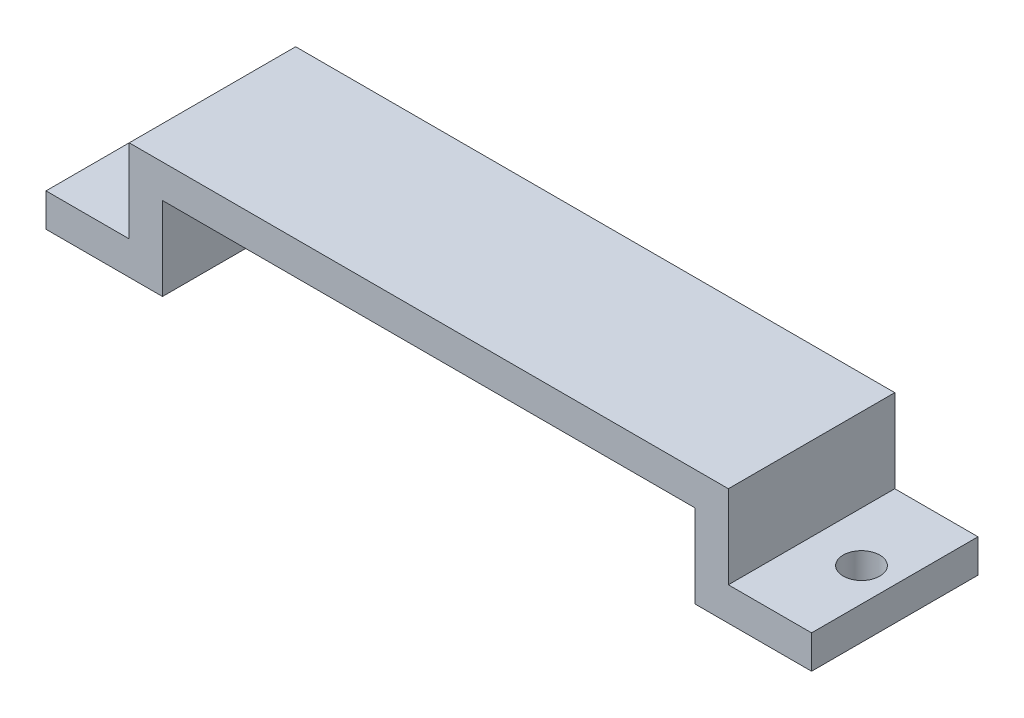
ISO-10303-21;
HEADER;
FILE_DESCRIPTION(('STEP AP214'),'2;1');
FILE_NAME('part.step','',(''),(''),'','','');
FILE_SCHEMA(('AUTOMOTIVE_DESIGN { 1 0 10303 214 1 1 1 1 }'));
ENDSEC;
DATA;
#1=APPLICATION_CONTEXT('core data for automotive mechanical design processes');
#2=APPLICATION_PROTOCOL_DEFINITION('international standard','automotive_design',2000,#1);
#3=PRODUCT_CONTEXT('',#1,'mechanical');
#4=PRODUCT('Part','Part','',(#3));
#5=PRODUCT_RELATED_PRODUCT_CATEGORY('part','',(#4));
#6=PRODUCT_DEFINITION_FORMATION('','',#4);
#7=PRODUCT_DEFINITION_CONTEXT('part definition',#1,'design');
#8=PRODUCT_DEFINITION('design','',#6,#7);
#9=PRODUCT_DEFINITION_SHAPE('','',#8);
#10=(LENGTH_UNIT() NAMED_UNIT(*) SI_UNIT(.MILLI.,.METRE.));
#11=(NAMED_UNIT(*) PLANE_ANGLE_UNIT() SI_UNIT($,.RADIAN.));
#12=(NAMED_UNIT(*) SI_UNIT($,.STERADIAN.) SOLID_ANGLE_UNIT());
#13=UNCERTAINTY_MEASURE_WITH_UNIT(LENGTH_MEASURE(1.E-05),#10,'distance_accuracy_value','');
#14=(GEOMETRIC_REPRESENTATION_CONTEXT(3) GLOBAL_UNCERTAINTY_ASSIGNED_CONTEXT((#13)) GLOBAL_UNIT_ASSIGNED_CONTEXT((#10,
#11,#12)) REPRESENTATION_CONTEXT('',''));
#15=CARTESIAN_POINT('',(0.,0.,0.));
#16=DIRECTION('',(0.,0.,1.));
#17=DIRECTION('',(1.,0.,0.));
#18=AXIS2_PLACEMENT_3D('',#15,#16,#17);
#19=CARTESIAN_POINT('',(-16.,0.,5.));
#20=DIRECTION('',(-1.,0.,0.));
#21=DIRECTION('',(0.,0.,1.));
#22=AXIS2_PLACEMENT_3D('',#19,#20,#21);
#23=PLANE('',#22);
#24=DIRECTION('',(0.,1.,0.));
#25=VECTOR('',#24,1.);
#26=CARTESIAN_POINT('',(-16.,0.,-5.));
#27=LINE('',#26,#25);
#28=CARTESIAN_POINT('',(-16.,-5.,-5.));
#29=VERTEX_POINT('',#28);
#30=CARTESIAN_POINT('',(-16.,0.,-5.));
#31=VERTEX_POINT('',#30);
#32=EDGE_CURVE('E170',#29,#31,#27,.T.);
#33=ORIENTED_EDGE('',*,*,#32,.T.);
#34=DIRECTION('',(0.,0.,-1.));
#35=VECTOR('',#34,1.);
#36=CARTESIAN_POINT('',(-16.,0.,5.));
#37=LINE('',#36,#35);
#38=CARTESIAN_POINT('',(-16.,0.,5.));
#39=VERTEX_POINT('',#38);
#40=EDGE_CURVE('E11',#39,#31,#37,.T.);
#41=ORIENTED_EDGE('',*,*,#40,.F.);
#42=DIRECTION('',(0.,1.,0.));
#43=VECTOR('',#42,1.);
#44=CARTESIAN_POINT('',(-16.,0.,5.));
#45=LINE('',#44,#43);
#46=CARTESIAN_POINT('',(-16.,-5.,5.));
#47=VERTEX_POINT('',#46);
#48=EDGE_CURVE('E205',#47,#39,#45,.T.);
#49=ORIENTED_EDGE('',*,*,#48,.F.);
#50=DIRECTION('',(0.,0.,-1.));
#51=VECTOR('',#50,1.);
#52=CARTESIAN_POINT('',(-16.,-5.,5.));
#53=LINE('',#52,#51);
#54=EDGE_CURVE('E166',#47,#29,#53,.T.);
#55=ORIENTED_EDGE('',*,*,#54,.T.);
#56=EDGE_LOOP('',(#33,#41,#49,#55));
#57=FACE_BOUND('',#56,.T.);
#58=ADVANCED_FACE('F45',(#57),#23,.F.);
#59=CARTESIAN_POINT('',(-16.,0.,5.));
#60=DIRECTION('',(0.,1.,0.));
#61=DIRECTION('',(-1.,0.,0.));
#62=AXIS2_PLACEMENT_3D('',#59,#60,#61);
#63=PLANE('',#62);
#64=DIRECTION('',(1.,0.,0.));
#65=VECTOR('',#64,1.);
#66=CARTESIAN_POINT('',(-16.,0.,-5.));
#67=LINE('',#66,#65);
#68=CARTESIAN_POINT('',(16.,0.,-5.));
#69=VERTEX_POINT('',#68);
#70=EDGE_CURVE('E174',#31,#69,#67,.T.);
#71=ORIENTED_EDGE('',*,*,#70,.T.);
#72=DIRECTION('',(0.,0.,-1.));
#73=VECTOR('',#72,1.);
#74=CARTESIAN_POINT('',(16.,0.,5.));
#75=LINE('',#74,#73);
#76=CARTESIAN_POINT('',(16.,0.,5.));
#77=VERTEX_POINT('',#76);
#78=EDGE_CURVE('E54',#77,#69,#75,.T.);
#79=ORIENTED_EDGE('',*,*,#78,.F.);
#80=DIRECTION('',(1.,0.,0.));
#81=VECTOR('',#80,1.);
#82=CARTESIAN_POINT('',(-16.,0.,5.));
#83=LINE('',#82,#81);
#84=EDGE_CURVE('E117',#39,#77,#83,.T.);
#85=ORIENTED_EDGE('',*,*,#84,.F.);
#86=ORIENTED_EDGE('',*,*,#40,.T.);
#87=EDGE_LOOP('',(#71,#79,#85,#86));
#88=FACE_BOUND('',#87,.T.);
#89=ADVANCED_FACE('F303',(#88),#63,.F.);
#90=CARTESIAN_POINT('',(16.,0.,5.));
#91=DIRECTION('',(1.,0.,0.));
#92=DIRECTION('',(0.,0.,-1.));
#93=AXIS2_PLACEMENT_3D('',#90,#91,#92);
#94=PLANE('',#93);
#95=DIRECTION('',(0.,-1.,0.));
#96=VECTOR('',#95,1.);
#97=CARTESIAN_POINT('',(16.,0.,-5.));
#98=LINE('',#97,#96);
#99=CARTESIAN_POINT('',(16.,-4.99999999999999,-5.));
#100=VERTEX_POINT('',#99);
#101=EDGE_CURVE('E178',#69,#100,#98,.T.);
#102=ORIENTED_EDGE('',*,*,#101,.T.);
#103=DIRECTION('',(0.,0.,-1.));
#104=VECTOR('',#103,1.);
#105=CARTESIAN_POINT('',(16.,-4.99999999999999,5.));
#106=LINE('',#105,#104);
#107=CARTESIAN_POINT('',(16.,-4.99999999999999,5.));
#108=VERTEX_POINT('',#107);
#109=EDGE_CURVE('E232',#108,#100,#106,.T.);
#110=ORIENTED_EDGE('',*,*,#109,.F.);
#111=DIRECTION('',(0.,-1.,0.));
#112=VECTOR('',#111,1.);
#113=CARTESIAN_POINT('',(16.,0.,5.));
#114=LINE('',#113,#112);
#115=EDGE_CURVE('E242',#77,#108,#114,.T.);
#116=ORIENTED_EDGE('',*,*,#115,.F.);
#117=ORIENTED_EDGE('',*,*,#78,.T.);
#118=EDGE_LOOP('',(#102,#110,#116,#117));
#119=FACE_BOUND('',#118,.T.);
#120=ADVANCED_FACE('F240',(#119),#94,.F.);
#121=CARTESIAN_POINT('',(16.,-4.99999999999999,5.));
#122=DIRECTION('',(0.,1.,0.));
#123=DIRECTION('',(0.,0.,1.));
#124=AXIS2_PLACEMENT_3D('',#121,#122,#123);
#125=PLANE('',#124);
#126=CARTESIAN_POINT('',(21.,-5.,0.));
#127=DIRECTION('',(0.,1.,0.));
#128=DIRECTION('',(0.,0.,1.));
#129=AXIS2_PLACEMENT_3D('',#126,#127,#128);
#130=CIRCLE('',#129,1.1);
#131=CARTESIAN_POINT('',(21.,-5.,1.1));
#132=VERTEX_POINT('',#131);
#133=EDGE_CURVE('E175',#132,#132,#130,.T.);
#134=ORIENTED_EDGE('',*,*,#133,.T.);
#135=EDGE_LOOP('',(#134));
#136=FACE_BOUND('',#135,.T.);
#137=DIRECTION('',(1.,0.,0.));
#138=VECTOR('',#137,1.);
#139=CARTESIAN_POINT('',(16.,-4.99999999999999,-5.));
#140=LINE('',#139,#138);
#141=CARTESIAN_POINT('',(23.,-4.99999999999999,-5.));
#142=VERTEX_POINT('',#141);
#143=EDGE_CURVE('E181',#100,#142,#140,.T.);
#144=ORIENTED_EDGE('',*,*,#143,.T.);
#145=DIRECTION('',(0.,0.,-1.));
#146=VECTOR('',#145,1.);
#147=CARTESIAN_POINT('',(23.,-4.99999999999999,5.));
#148=LINE('',#147,#146);
#149=CARTESIAN_POINT('',(23.,-4.99999999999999,5.));
#150=VERTEX_POINT('',#149);
#151=EDGE_CURVE('E228',#150,#142,#148,.T.);
#152=ORIENTED_EDGE('',*,*,#151,.F.);
#153=DIRECTION('',(1.,0.,0.));
#154=VECTOR('',#153,1.);
#155=CARTESIAN_POINT('',(16.,-4.99999999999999,5.));
#156=LINE('',#155,#154);
#157=EDGE_CURVE('E261',#108,#150,#156,.T.);
#158=ORIENTED_EDGE('',*,*,#157,.F.);
#159=ORIENTED_EDGE('',*,*,#109,.T.);
#160=EDGE_LOOP('',(#144,#152,#158,#159));
#161=FACE_BOUND('',#160,.T.);
#162=ADVANCED_FACE('F251',(#136,#161),#125,.F.);
#163=CARTESIAN_POINT('',(23.,-2.99999999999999,5.));
#164=DIRECTION('',(-1.,0.,0.));
#165=DIRECTION('',(0.,0.,1.));
#166=AXIS2_PLACEMENT_3D('',#163,#164,#165);
#167=PLANE('',#166);
#168=DIRECTION('',(0.,1.,0.));
#169=VECTOR('',#168,1.);
#170=CARTESIAN_POINT('',(23.,-2.99999999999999,-5.));
#171=LINE('',#170,#169);
#172=CARTESIAN_POINT('',(23.,-2.99999999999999,-5.));
#173=VERTEX_POINT('',#172);
#174=EDGE_CURVE('E184',#142,#173,#171,.T.);
#175=ORIENTED_EDGE('',*,*,#174,.T.);
#176=DIRECTION('',(0.,0.,-1.));
#177=VECTOR('',#176,1.);
#178=CARTESIAN_POINT('',(23.,-2.99999999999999,5.));
#179=LINE('',#178,#177);
#180=CARTESIAN_POINT('',(23.,-2.99999999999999,5.));
#181=VERTEX_POINT('',#180);
#182=EDGE_CURVE('E224',#181,#173,#179,.T.);
#183=ORIENTED_EDGE('',*,*,#182,.F.);
#184=DIRECTION('',(0.,1.,0.));
#185=VECTOR('',#184,1.);
#186=CARTESIAN_POINT('',(23.,-2.99999999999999,5.));
#187=LINE('',#186,#185);
#188=EDGE_CURVE('E257',#150,#181,#187,.T.);
#189=ORIENTED_EDGE('',*,*,#188,.F.);
#190=ORIENTED_EDGE('',*,*,#151,.T.);
#191=EDGE_LOOP('',(#175,#183,#189,#190));
#192=FACE_BOUND('',#191,.T.);
#193=ADVANCED_FACE('F255',(#192),#167,.F.);
#194=CARTESIAN_POINT('',(18.,-2.99999999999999,5.));
#195=DIRECTION('',(0.,-1.,0.));
#196=DIRECTION('',(0.,0.,-1.));
#197=AXIS2_PLACEMENT_3D('',#194,#195,#196);
#198=PLANE('',#197);
#199=CARTESIAN_POINT('',(21.,-2.99999999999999,0.));
#200=DIRECTION('',(0.,1.,0.));
#201=DIRECTION('',(0.,0.,1.));
#202=AXIS2_PLACEMENT_3D('',#199,#200,#201);
#203=CIRCLE('',#202,1.1);
#204=CARTESIAN_POINT('',(21.,-2.99999999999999,1.1));
#205=VERTEX_POINT('',#204);
#206=EDGE_CURVE('E337',#205,#205,#203,.T.);
#207=ORIENTED_EDGE('',*,*,#206,.F.);
#208=EDGE_LOOP('',(#207));
#209=FACE_BOUND('',#208,.T.);
#210=DIRECTION('',(-1.,0.,0.));
#211=VECTOR('',#210,1.);
#212=CARTESIAN_POINT('',(18.,-2.99999999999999,-5.));
#213=LINE('',#212,#211);
#214=CARTESIAN_POINT('',(18.,-2.99999999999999,-5.));
#215=VERTEX_POINT('',#214);
#216=EDGE_CURVE('E187',#173,#215,#213,.T.);
#217=ORIENTED_EDGE('',*,*,#216,.T.);
#218=DIRECTION('',(0.,0.,-1.));
#219=VECTOR('',#218,1.);
#220=CARTESIAN_POINT('',(18.,-2.99999999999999,5.));
#221=LINE('',#220,#219);
#222=CARTESIAN_POINT('',(18.,-2.99999999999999,5.));
#223=VERTEX_POINT('',#222);
#224=EDGE_CURVE('E220',#223,#215,#221,.T.);
#225=ORIENTED_EDGE('',*,*,#224,.F.);
#226=DIRECTION('',(-1.,0.,0.));
#227=VECTOR('',#226,1.);
#228=CARTESIAN_POINT('',(18.,-2.99999999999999,5.));
#229=LINE('',#228,#227);
#230=EDGE_CURVE('E260',#181,#223,#229,.T.);
#231=ORIENTED_EDGE('',*,*,#230,.F.);
#232=ORIENTED_EDGE('',*,*,#182,.T.);
#233=EDGE_LOOP('',(#217,#225,#231,#232));
#234=FACE_BOUND('',#233,.T.);
#235=ADVANCED_FACE('F317',(#209,#234),#198,.F.);
#236=CARTESIAN_POINT('',(18.,2.,5.));
#237=DIRECTION('',(-1.,0.,0.));
#238=DIRECTION('',(0.,0.,1.));
#239=AXIS2_PLACEMENT_3D('',#236,#237,#238);
#240=PLANE('',#239);
#241=DIRECTION('',(0.,1.,0.));
#242=VECTOR('',#241,1.);
#243=CARTESIAN_POINT('',(18.,2.,-5.));
#244=LINE('',#243,#242);
#245=CARTESIAN_POINT('',(18.,2.,-5.));
#246=VERTEX_POINT('',#245);
#247=EDGE_CURVE('E190',#215,#246,#244,.T.);
#248=ORIENTED_EDGE('',*,*,#247,.T.);
#249=DIRECTION('',(0.,0.,-1.));
#250=VECTOR('',#249,1.);
#251=CARTESIAN_POINT('',(18.,2.,5.));
#252=LINE('',#251,#250);
#253=CARTESIAN_POINT('',(18.,2.,5.));
#254=VERTEX_POINT('',#253);
#255=EDGE_CURVE('E216',#254,#246,#252,.T.);
#256=ORIENTED_EDGE('',*,*,#255,.F.);
#257=DIRECTION('',(0.,1.,0.));
#258=VECTOR('',#257,1.);
#259=CARTESIAN_POINT('',(18.,2.,5.));
#260=LINE('',#259,#258);
#261=EDGE_CURVE('E265',#223,#254,#260,.T.);
#262=ORIENTED_EDGE('',*,*,#261,.F.);
#263=ORIENTED_EDGE('',*,*,#224,.T.);
#264=EDGE_LOOP('',(#248,#256,#262,#263));
#265=FACE_BOUND('',#264,.T.);
#266=ADVANCED_FACE('F320',(#265),#240,.F.);
#267=CARTESIAN_POINT('',(-18.,2.,5.));
#268=DIRECTION('',(0.,-1.,0.));
#269=DIRECTION('',(0.,0.,-1.));
#270=AXIS2_PLACEMENT_3D('',#267,#268,#269);
#271=PLANE('',#270);
#272=DIRECTION('',(-1.,0.,0.));
#273=VECTOR('',#272,1.);
#274=CARTESIAN_POINT('',(-18.,2.,-5.));
#275=LINE('',#274,#273);
#276=CARTESIAN_POINT('',(-18.,2.,-5.));
#277=VERTEX_POINT('',#276);
#278=EDGE_CURVE('E193',#246,#277,#275,.T.);
#279=ORIENTED_EDGE('',*,*,#278,.T.);
#280=DIRECTION('',(0.,0.,-1.));
#281=VECTOR('',#280,1.);
#282=CARTESIAN_POINT('',(-18.,2.,5.));
#283=LINE('',#282,#281);
#284=CARTESIAN_POINT('',(-18.,2.,5.));
#285=VERTEX_POINT('',#284);
#286=EDGE_CURVE('E212',#285,#277,#283,.T.);
#287=ORIENTED_EDGE('',*,*,#286,.F.);
#288=DIRECTION('',(-1.,0.,0.));
#289=VECTOR('',#288,1.);
#290=CARTESIAN_POINT('',(-18.,2.,5.));
#291=LINE('',#290,#289);
#292=EDGE_CURVE('E272',#254,#285,#291,.T.);
#293=ORIENTED_EDGE('',*,*,#292,.F.);
#294=ORIENTED_EDGE('',*,*,#255,.T.);
#295=EDGE_LOOP('',(#279,#287,#293,#294));
#296=FACE_BOUND('',#295,.T.);
#297=ADVANCED_FACE('F280',(#296),#271,.F.);
#298=CARTESIAN_POINT('',(-18.,2.,5.));
#299=DIRECTION('',(1.,0.,0.));
#300=DIRECTION('',(0.,0.,-1.));
#301=AXIS2_PLACEMENT_3D('',#298,#299,#300);
#302=PLANE('',#301);
#303=DIRECTION('',(0.,-1.,0.));
#304=VECTOR('',#303,1.);
#305=CARTESIAN_POINT('',(-18.,2.,-5.));
#306=LINE('',#305,#304);
#307=CARTESIAN_POINT('',(-18.,-3.,-5.));
#308=VERTEX_POINT('',#307);
#309=EDGE_CURVE('E196',#277,#308,#306,.T.);
#310=ORIENTED_EDGE('',*,*,#309,.T.);
#311=DIRECTION('',(0.,0.,-1.));
#312=VECTOR('',#311,1.);
#313=CARTESIAN_POINT('',(-18.,-3.,5.));
#314=LINE('',#313,#312);
#315=CARTESIAN_POINT('',(-18.,-3.,5.));
#316=VERTEX_POINT('',#315);
#317=EDGE_CURVE('E159',#316,#308,#314,.T.);
#318=ORIENTED_EDGE('',*,*,#317,.F.);
#319=DIRECTION('',(0.,-1.,0.));
#320=VECTOR('',#319,1.);
#321=CARTESIAN_POINT('',(-18.,2.,5.));
#322=LINE('',#321,#320);
#323=EDGE_CURVE('E148',#285,#316,#322,.T.);
#324=ORIENTED_EDGE('',*,*,#323,.F.);
#325=ORIENTED_EDGE('',*,*,#286,.T.);
#326=EDGE_LOOP('',(#310,#318,#324,#325));
#327=FACE_BOUND('',#326,.T.);
#328=ADVANCED_FACE('F284',(#327),#302,.F.);
#329=CARTESIAN_POINT('',(-18.,-3.,5.));
#330=DIRECTION('',(0.,-1.,0.));
#331=DIRECTION('',(1.,0.,0.));
#332=AXIS2_PLACEMENT_3D('',#329,#330,#331);
#333=PLANE('',#332);
#334=CARTESIAN_POINT('',(-21.,-2.99999999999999,0.));
#335=DIRECTION('',(0.,1.,0.));
#336=DIRECTION('',(0.,0.,-1.));
#337=AXIS2_PLACEMENT_3D('',#334,#335,#336);
#338=CIRCLE('',#337,1.1);
#339=CARTESIAN_POINT('',(-21.,-2.99999999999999,-1.1));
#340=VERTEX_POINT('',#339);
#341=EDGE_CURVE('E334',#340,#340,#338,.T.);
#342=ORIENTED_EDGE('',*,*,#341,.F.);
#343=EDGE_LOOP('',(#342));
#344=FACE_BOUND('',#343,.T.);
#345=DIRECTION('',(-1.,0.,0.));
#346=VECTOR('',#345,1.);
#347=CARTESIAN_POINT('',(-18.,-3.,-5.));
#348=LINE('',#347,#346);
#349=CARTESIAN_POINT('',(-23.,-3.,-5.));
#350=VERTEX_POINT('',#349);
#351=EDGE_CURVE('E157',#308,#350,#348,.T.);
#352=ORIENTED_EDGE('',*,*,#351,.T.);
#353=DIRECTION('',(0.,0.,-1.));
#354=VECTOR('',#353,1.);
#355=CARTESIAN_POINT('',(-23.,-3.,5.));
#356=LINE('',#355,#354);
#357=CARTESIAN_POINT('',(-23.,-3.,5.));
#358=VERTEX_POINT('',#357);
#359=EDGE_CURVE('E154',#358,#350,#356,.T.);
#360=ORIENTED_EDGE('',*,*,#359,.F.);
#361=DIRECTION('',(-1.,0.,0.));
#362=VECTOR('',#361,1.);
#363=CARTESIAN_POINT('',(-18.,-3.,5.));
#364=LINE('',#363,#362);
#365=EDGE_CURVE('E142',#316,#358,#364,.T.);
#366=ORIENTED_EDGE('',*,*,#365,.F.);
#367=ORIENTED_EDGE('',*,*,#317,.T.);
#368=EDGE_LOOP('',(#352,#360,#366,#367));
#369=FACE_BOUND('',#368,.T.);
#370=ADVANCED_FACE('F155',(#344,#369),#333,.F.);
#371=CARTESIAN_POINT('',(-23.,-3.,5.));
#372=DIRECTION('',(1.,0.,0.));
#373=DIRECTION('',(0.,0.,-1.));
#374=AXIS2_PLACEMENT_3D('',#371,#372,#373);
#375=PLANE('',#374);
#376=DIRECTION('',(0.,-1.,0.));
#377=VECTOR('',#376,1.);
#378=CARTESIAN_POINT('',(-23.,-3.,-5.));
#379=LINE('',#378,#377);
#380=CARTESIAN_POINT('',(-23.,-5.,-5.));
#381=VERTEX_POINT('',#380);
#382=EDGE_CURVE('E103',#350,#381,#379,.T.);
#383=ORIENTED_EDGE('',*,*,#382,.T.);
#384=DIRECTION('',(0.,0.,-1.));
#385=VECTOR('',#384,1.);
#386=CARTESIAN_POINT('',(-23.,-5.,5.));
#387=LINE('',#386,#385);
#388=CARTESIAN_POINT('',(-23.,-5.,5.));
#389=VERTEX_POINT('',#388);
#390=EDGE_CURVE('E160',#389,#381,#387,.T.);
#391=ORIENTED_EDGE('',*,*,#390,.F.);
#392=DIRECTION('',(0.,-1.,0.));
#393=VECTOR('',#392,1.);
#394=CARTESIAN_POINT('',(-23.,-3.,5.));
#395=LINE('',#394,#393);
#396=EDGE_CURVE('E146',#358,#389,#395,.T.);
#397=ORIENTED_EDGE('',*,*,#396,.F.);
#398=ORIENTED_EDGE('',*,*,#359,.T.);
#399=EDGE_LOOP('',(#383,#391,#397,#398));
#400=FACE_BOUND('',#399,.T.);
#401=ADVANCED_FACE('F162',(#400),#375,.F.);
#402=CARTESIAN_POINT('',(-16.,-5.,5.));
#403=DIRECTION('',(0.,1.,0.));
#404=DIRECTION('',(0.,0.,1.));
#405=AXIS2_PLACEMENT_3D('',#402,#403,#404);
#406=PLANE('',#405);
#407=CARTESIAN_POINT('',(-21.,-5.,0.));
#408=DIRECTION('',(0.,1.,0.));
#409=DIRECTION('',(0.,0.,-1.));
#410=AXIS2_PLACEMENT_3D('',#407,#408,#409);
#411=CIRCLE('',#410,1.1);
#412=CARTESIAN_POINT('',(-21.,-5.,-1.1));
#413=VERTEX_POINT('',#412);
#414=EDGE_CURVE('E338',#413,#413,#411,.T.);
#415=ORIENTED_EDGE('',*,*,#414,.T.);
#416=EDGE_LOOP('',(#415));
#417=FACE_BOUND('',#416,.T.);
#418=DIRECTION('',(1.,0.,0.));
#419=VECTOR('',#418,1.);
#420=CARTESIAN_POINT('',(-16.,-5.,-5.));
#421=LINE('',#420,#419);
#422=EDGE_CURVE('E109',#381,#29,#421,.T.);
#423=ORIENTED_EDGE('',*,*,#422,.T.);
#424=ORIENTED_EDGE('',*,*,#54,.F.);
#425=DIRECTION('',(1.,0.,0.));
#426=VECTOR('',#425,1.);
#427=CARTESIAN_POINT('',(-16.,-5.,5.));
#428=LINE('',#427,#426);
#429=EDGE_CURVE('E62',#389,#47,#428,.T.);
#430=ORIENTED_EDGE('',*,*,#429,.F.);
#431=ORIENTED_EDGE('',*,*,#390,.T.);
#432=EDGE_LOOP('',(#423,#424,#430,#431));
#433=FACE_BOUND('',#432,.T.);
#434=ADVANCED_FACE('F288',(#417,#433),#406,.F.);
#435=CARTESIAN_POINT('',(0.,0.,5.));
#436=DIRECTION('',(0.,0.,-1.));
#437=DIRECTION('',(-1.,0.,0.));
#438=AXIS2_PLACEMENT_3D('',#435,#436,#437);
#439=PLANE('',#438);
#440=ORIENTED_EDGE('',*,*,#48,.T.);
#441=ORIENTED_EDGE('',*,*,#84,.T.);
#442=ORIENTED_EDGE('',*,*,#115,.T.);
#443=ORIENTED_EDGE('',*,*,#157,.T.);
#444=ORIENTED_EDGE('',*,*,#188,.T.);
#445=ORIENTED_EDGE('',*,*,#230,.T.);
#446=ORIENTED_EDGE('',*,*,#261,.T.);
#447=ORIENTED_EDGE('',*,*,#292,.T.);
#448=ORIENTED_EDGE('',*,*,#323,.T.);
#449=ORIENTED_EDGE('',*,*,#365,.T.);
#450=ORIENTED_EDGE('',*,*,#396,.T.);
#451=ORIENTED_EDGE('',*,*,#429,.T.);
#452=EDGE_LOOP('',(#440,#441,#442,#443,#444,#445,#446,#447,#448,#449,#450,#451));
#453=FACE_BOUND('',#452,.T.);
#454=ADVANCED_FACE('F144',(#453),#439,.F.);
#455=CARTESIAN_POINT('',(0.,0.,-5.));
#456=DIRECTION('',(0.,0.,-1.));
#457=DIRECTION('',(-1.,0.,0.));
#458=AXIS2_PLACEMENT_3D('',#455,#456,#457);
#459=PLANE('',#458);
#460=ORIENTED_EDGE('',*,*,#32,.F.);
#461=ORIENTED_EDGE('',*,*,#422,.F.);
#462=ORIENTED_EDGE('',*,*,#382,.F.);
#463=ORIENTED_EDGE('',*,*,#351,.F.);
#464=ORIENTED_EDGE('',*,*,#309,.F.);
#465=ORIENTED_EDGE('',*,*,#278,.F.);
#466=ORIENTED_EDGE('',*,*,#247,.F.);
#467=ORIENTED_EDGE('',*,*,#216,.F.);
#468=ORIENTED_EDGE('',*,*,#174,.F.);
#469=ORIENTED_EDGE('',*,*,#143,.F.);
#470=ORIENTED_EDGE('',*,*,#101,.F.);
#471=ORIENTED_EDGE('',*,*,#70,.F.);
#472=EDGE_LOOP('',(#460,#461,#462,#463,#464,#465,#466,#467,#468,#469,#470,#471));
#473=FACE_BOUND('',#472,.T.);
#474=ADVANCED_FACE('F246',(#473),#459,.T.);
#475=CARTESIAN_POINT('',(-21.,-5.,0.));
#476=DIRECTION('',(0.,1.,0.));
#477=DIRECTION('',(0.,0.,1.));
#478=AXIS2_PLACEMENT_3D('',#475,#476,#477);
#479=CYLINDRICAL_SURFACE('',#478,1.1);
#480=ORIENTED_EDGE('',*,*,#414,.F.);
#481=EDGE_LOOP('',(#480));
#482=FACE_BOUND('',#481,.T.);
#483=ORIENTED_EDGE('',*,*,#341,.T.);
#484=EDGE_LOOP('',(#483));
#485=FACE_BOUND('',#484,.T.);
#486=ADVANCED_FACE('F358',(#482,#485),#479,.F.);
#487=CARTESIAN_POINT('',(21.,-5.,0.));
#488=DIRECTION('',(0.,1.,0.));
#489=DIRECTION('',(0.,0.,1.));
#490=AXIS2_PLACEMENT_3D('',#487,#488,#489);
#491=CYLINDRICAL_SURFACE('',#490,1.1);
#492=ORIENTED_EDGE('',*,*,#133,.F.);
#493=EDGE_LOOP('',(#492));
#494=FACE_BOUND('',#493,.T.);
#495=ORIENTED_EDGE('',*,*,#206,.T.);
#496=EDGE_LOOP('',(#495));
#497=FACE_BOUND('',#496,.T.);
#498=ADVANCED_FACE('F355',(#494,#497),#491,.F.);
#499=CLOSED_SHELL('',(#58,#89,#120,#162,#193,#235,#266,#297,#328,#370,#401,#434,#454,#474,#486,#498));
#500=MANIFOLD_SOLID_BREP('B2',#499);
#501=ADVANCED_BREP_SHAPE_REPRESENTATION('',(#18,#500),#14);
#502=SHAPE_DEFINITION_REPRESENTATION(#9,#501);
ENDSEC;
END-ISO-10303-21;
